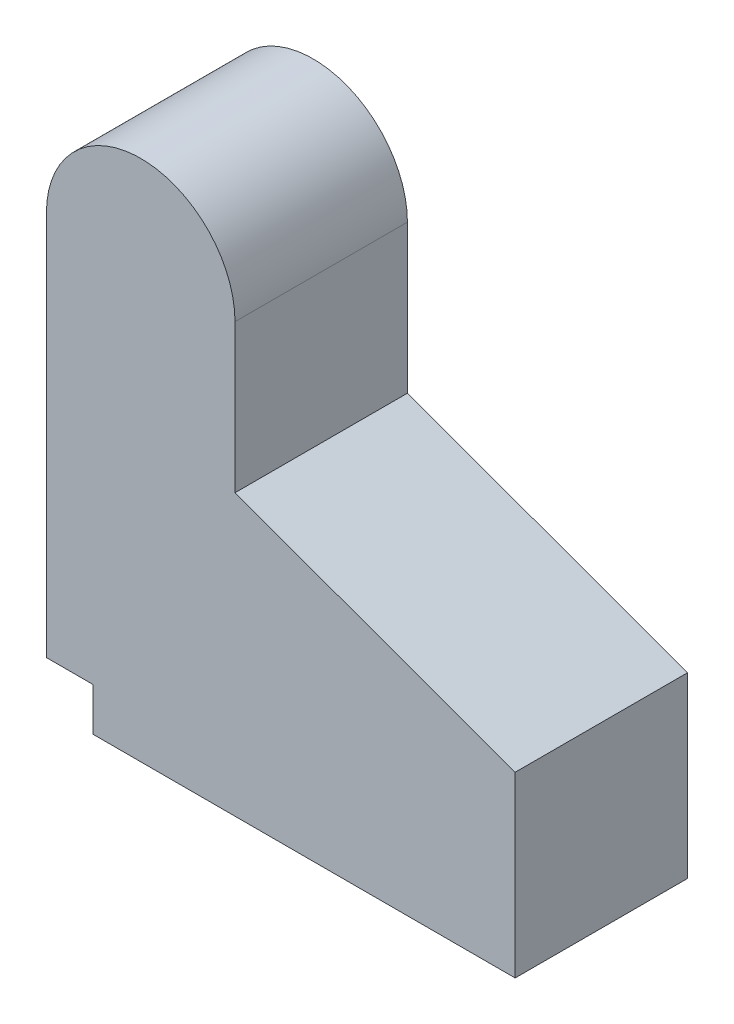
ISO-10303-21;
HEADER;
FILE_DESCRIPTION(('STEP AP214'),'2;1');
FILE_NAME('part.step','',(''),(''),'','','');
FILE_SCHEMA(('AUTOMOTIVE_DESIGN { 1 0 10303 214 1 1 1 1 }'));
ENDSEC;
DATA;
#1=APPLICATION_CONTEXT('core data for automotive mechanical design processes');
#2=APPLICATION_PROTOCOL_DEFINITION('international standard','automotive_design',2000,#1);
#3=PRODUCT_CONTEXT('',#1,'mechanical');
#4=PRODUCT('Part','Part','',(#3));
#5=PRODUCT_RELATED_PRODUCT_CATEGORY('part','',(#4));
#6=PRODUCT_DEFINITION_FORMATION('','',#4);
#7=PRODUCT_DEFINITION_CONTEXT('part definition',#1,'design');
#8=PRODUCT_DEFINITION('design','',#6,#7);
#9=PRODUCT_DEFINITION_SHAPE('','',#8);
#10=(LENGTH_UNIT() NAMED_UNIT(*) SI_UNIT(.MILLI.,.METRE.));
#11=(NAMED_UNIT(*) PLANE_ANGLE_UNIT() SI_UNIT($,.RADIAN.));
#12=(NAMED_UNIT(*) SI_UNIT($,.STERADIAN.) SOLID_ANGLE_UNIT());
#13=UNCERTAINTY_MEASURE_WITH_UNIT(LENGTH_MEASURE(1.E-05),#10,'distance_accuracy_value','');
#14=(GEOMETRIC_REPRESENTATION_CONTEXT(3) GLOBAL_UNCERTAINTY_ASSIGNED_CONTEXT((#13)) GLOBAL_UNIT_ASSIGNED_CONTEXT((#10,
#11,#12)) REPRESENTATION_CONTEXT('',''));
#15=CARTESIAN_POINT('',(0.,0.,0.));
#16=DIRECTION('',(0.,0.,1.));
#17=DIRECTION('',(1.,0.,0.));
#18=AXIS2_PLACEMENT_3D('',#15,#16,#17);
#19=CARTESIAN_POINT('',(4.3,0.,16.));
#20=DIRECTION('',(1.,0.,0.));
#21=DIRECTION('',(0.,1.,0.));
#22=AXIS2_PLACEMENT_3D('',#19,#20,#21);
#23=PLANE('',#22);
#24=DIRECTION('',(0.,-1.,0.));
#25=VECTOR('',#24,1.);
#26=CARTESIAN_POINT('',(4.3,0.,0.));
#27=LINE('',#26,#25);
#28=CARTESIAN_POINT('',(4.3,4.,0.));
#29=VERTEX_POINT('',#28);
#30=CARTESIAN_POINT('',(4.3,0.,0.));
#31=VERTEX_POINT('',#30);
#32=EDGE_CURVE('E127',#29,#31,#27,.T.);
#33=ORIENTED_EDGE('',*,*,#32,.T.);
#34=DIRECTION('',(0.,0.,-1.));
#35=VECTOR('',#34,1.);
#36=CARTESIAN_POINT('',(4.3,0.,16.));
#37=LINE('',#36,#35);
#38=CARTESIAN_POINT('',(4.3,0.,16.));
#39=VERTEX_POINT('',#38);
#40=EDGE_CURVE('E11',#39,#31,#37,.T.);
#41=ORIENTED_EDGE('',*,*,#40,.F.);
#42=DIRECTION('',(0.,-1.,0.));
#43=VECTOR('',#42,1.);
#44=CARTESIAN_POINT('',(4.3,0.,16.));
#45=LINE('',#44,#43);
#46=CARTESIAN_POINT('',(4.3,4.,16.));
#47=VERTEX_POINT('',#46);
#48=EDGE_CURVE('E141',#47,#39,#45,.T.);
#49=ORIENTED_EDGE('',*,*,#48,.F.);
#50=DIRECTION('',(0.,0.,-1.));
#51=VECTOR('',#50,1.);
#52=CARTESIAN_POINT('',(4.3,4.,16.));
#53=LINE('',#52,#51);
#54=EDGE_CURVE('E123',#47,#29,#53,.T.);
#55=ORIENTED_EDGE('',*,*,#54,.T.);
#56=EDGE_LOOP('',(#33,#41,#49,#55));
#57=FACE_BOUND('',#56,.T.);
#58=ADVANCED_FACE('F31',(#57),#23,.F.);
#59=CARTESIAN_POINT('',(4.3,0.,16.));
#60=DIRECTION('',(0.,1.,0.));
#61=DIRECTION('',(-1.,0.,0.));
#62=AXIS2_PLACEMENT_3D('',#59,#60,#61);
#63=PLANE('',#62);
#64=DIRECTION('',(1.,0.,0.));
#65=VECTOR('',#64,1.);
#66=CARTESIAN_POINT('',(4.3,0.,0.));
#67=LINE('',#66,#65);
#68=CARTESIAN_POINT('',(43.5,0.,0.));
#69=VERTEX_POINT('',#68);
#70=EDGE_CURVE('E130',#31,#69,#67,.T.);
#71=ORIENTED_EDGE('',*,*,#70,.T.);
#72=DIRECTION('',(0.,0.,-1.));
#73=VECTOR('',#72,1.);
#74=CARTESIAN_POINT('',(43.5,0.,16.));
#75=LINE('',#74,#73);
#76=CARTESIAN_POINT('',(43.5,0.,16.));
#77=VERTEX_POINT('',#76);
#78=EDGE_CURVE('E39',#77,#69,#75,.T.);
#79=ORIENTED_EDGE('',*,*,#78,.F.);
#80=DIRECTION('',(1.,0.,0.));
#81=VECTOR('',#80,1.);
#82=CARTESIAN_POINT('',(4.3,0.,16.));
#83=LINE('',#82,#81);
#84=EDGE_CURVE('E90',#39,#77,#83,.T.);
#85=ORIENTED_EDGE('',*,*,#84,.F.);
#86=ORIENTED_EDGE('',*,*,#40,.T.);
#87=EDGE_LOOP('',(#71,#79,#85,#86));
#88=FACE_BOUND('',#87,.T.);
#89=ADVANCED_FACE('F176',(#88),#63,.F.);
#90=CARTESIAN_POINT('',(43.5,0.,16.));
#91=DIRECTION('',(-1.,0.,0.));
#92=DIRECTION('',(0.,0.,1.));
#93=AXIS2_PLACEMENT_3D('',#90,#91,#92);
#94=PLANE('',#93);
#95=DIRECTION('',(0.,1.,0.));
#96=VECTOR('',#95,1.);
#97=CARTESIAN_POINT('',(43.5,0.,0.));
#98=LINE('',#97,#96);
#99=CARTESIAN_POINT('',(43.5,16.5367739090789,0.));
#100=VERTEX_POINT('',#99);
#101=EDGE_CURVE('E132',#69,#100,#98,.T.);
#102=ORIENTED_EDGE('',*,*,#101,.T.);
#103=DIRECTION('',(0.,0.,-1.));
#104=VECTOR('',#103,1.);
#105=CARTESIAN_POINT('',(43.5,16.5367739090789,16.));
#106=LINE('',#105,#104);
#107=CARTESIAN_POINT('',(43.5,16.5367739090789,16.));
#108=VERTEX_POINT('',#107);
#109=EDGE_CURVE('E148',#108,#100,#106,.T.);
#110=ORIENTED_EDGE('',*,*,#109,.F.);
#111=DIRECTION('',(0.,1.,0.));
#112=VECTOR('',#111,1.);
#113=CARTESIAN_POINT('',(43.5,0.,16.));
#114=LINE('',#113,#112);
#115=EDGE_CURVE('E156',#77,#108,#114,.T.);
#116=ORIENTED_EDGE('',*,*,#115,.F.);
#117=ORIENTED_EDGE('',*,*,#78,.T.);
#118=EDGE_LOOP('',(#102,#110,#116,#117));
#119=FACE_BOUND('',#118,.T.);
#120=ADVANCED_FACE('F154',(#119),#94,.F.);
#121=CARTESIAN_POINT('',(43.5,16.5367739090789,16.));
#122=DIRECTION('',(-0.342020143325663,-0.939692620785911,0.));
#123=DIRECTION('',(0.939692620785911,-0.342020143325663,0.));
#124=AXIS2_PLACEMENT_3D('',#121,#122,#123);
#125=PLANE('',#124);
#126=DIRECTION('',(-0.939692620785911,0.342020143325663,0.));
#127=VECTOR('',#126,1.);
#128=CARTESIAN_POINT('',(43.5,16.5367739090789,0.));
#129=LINE('',#128,#127);
#130=CARTESIAN_POINT('',(17.5,26.,0.));
#131=VERTEX_POINT('',#130);
#132=EDGE_CURVE('E134',#100,#131,#129,.T.);
#133=ORIENTED_EDGE('',*,*,#132,.T.);
#134=DIRECTION('',(0.,0.,-1.));
#135=VECTOR('',#134,1.);
#136=CARTESIAN_POINT('',(17.5,26.,16.));
#137=LINE('',#136,#135);
#138=CARTESIAN_POINT('',(17.5,26.,16.));
#139=VERTEX_POINT('',#138);
#140=EDGE_CURVE('E145',#139,#131,#137,.T.);
#141=ORIENTED_EDGE('',*,*,#140,.F.);
#142=DIRECTION('',(-0.939692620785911,0.342020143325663,0.));
#143=VECTOR('',#142,1.);
#144=CARTESIAN_POINT('',(43.5,16.5367739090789,16.));
#145=LINE('',#144,#143);
#146=EDGE_CURVE('E168',#108,#139,#145,.T.);
#147=ORIENTED_EDGE('',*,*,#146,.F.);
#148=ORIENTED_EDGE('',*,*,#109,.T.);
#149=EDGE_LOOP('',(#133,#141,#147,#148));
#150=FACE_BOUND('',#149,.T.);
#151=ADVANCED_FACE('F164',(#150),#125,.F.);
#152=CARTESIAN_POINT('',(17.5,26.,16.));
#153=DIRECTION('',(-1.,0.,0.));
#154=DIRECTION('',(0.,-1.,0.));
#155=AXIS2_PLACEMENT_3D('',#152,#153,#154);
#156=PLANE('',#155);
#157=DIRECTION('',(0.,1.,0.));
#158=VECTOR('',#157,1.);
#159=CARTESIAN_POINT('',(17.5,26.,0.));
#160=LINE('',#159,#158);
#161=CARTESIAN_POINT('',(17.5,39.75,0.));
#162=VERTEX_POINT('',#161);
#163=EDGE_CURVE('E136',#131,#162,#160,.T.);
#164=ORIENTED_EDGE('',*,*,#163,.T.);
#165=DIRECTION('',(0.,0.,-1.));
#166=VECTOR('',#165,1.);
#167=CARTESIAN_POINT('',(17.5,39.75,16.));
#168=LINE('',#167,#166);
#169=CARTESIAN_POINT('',(17.5,39.75,16.));
#170=VERTEX_POINT('',#169);
#171=EDGE_CURVE('E118',#170,#162,#168,.T.);
#172=ORIENTED_EDGE('',*,*,#171,.F.);
#173=DIRECTION('',(0.,1.,0.));
#174=VECTOR('',#173,1.);
#175=CARTESIAN_POINT('',(17.5,26.,16.));
#176=LINE('',#175,#174);
#177=EDGE_CURVE('E109',#139,#170,#176,.T.);
#178=ORIENTED_EDGE('',*,*,#177,.F.);
#179=ORIENTED_EDGE('',*,*,#140,.T.);
#180=EDGE_LOOP('',(#164,#172,#178,#179));
#181=FACE_BOUND('',#180,.T.);
#182=ADVANCED_FACE('F167',(#181),#156,.F.);
#183=CARTESIAN_POINT('',(8.74999999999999,39.75,16.));
#184=DIRECTION('',(0.,0.,-1.));
#185=DIRECTION('',(-1.,0.,0.));
#186=AXIS2_PLACEMENT_3D('',#183,#184,#185);
#187=CYLINDRICAL_SURFACE('',#186,8.75);
#188=CARTESIAN_POINT('',(8.74999999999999,39.75,0.));
#189=DIRECTION('',(0.,0.,1.));
#190=DIRECTION('',(-1.,0.,0.));
#191=AXIS2_PLACEMENT_3D('',#188,#189,#190);
#192=CIRCLE('',#191,8.75);
#193=CARTESIAN_POINT('',(0.,39.75,0.));
#194=VERTEX_POINT('',#193);
#195=EDGE_CURVE('E117',#162,#194,#192,.T.);
#196=ORIENTED_EDGE('',*,*,#195,.T.);
#197=DIRECTION('',(0.,0.,-1.));
#198=VECTOR('',#197,1.);
#199=CARTESIAN_POINT('',(0.,39.75,16.));
#200=LINE('',#199,#198);
#201=CARTESIAN_POINT('',(0.,39.75,16.));
#202=VERTEX_POINT('',#201);
#203=EDGE_CURVE('E114',#202,#194,#200,.T.);
#204=ORIENTED_EDGE('',*,*,#203,.F.);
#205=CARTESIAN_POINT('',(8.74999999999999,39.75,16.));
#206=DIRECTION('',(0.,0.,1.));
#207=DIRECTION('',(-1.,0.,0.));
#208=AXIS2_PLACEMENT_3D('',#205,#206,#207);
#209=CIRCLE('',#208,8.75);
#210=EDGE_CURVE('E103',#170,#202,#209,.T.);
#211=ORIENTED_EDGE('',*,*,#210,.F.);
#212=ORIENTED_EDGE('',*,*,#171,.T.);
#213=EDGE_LOOP('',(#196,#204,#211,#212));
#214=FACE_BOUND('',#213,.T.);
#215=ADVANCED_FACE('F115',(#214),#187,.T.);
#216=CARTESIAN_POINT('',(0.,4.,16.));
#217=DIRECTION('',(1.,0.,0.));
#218=DIRECTION('',(0.,1.,0.));
#219=AXIS2_PLACEMENT_3D('',#216,#217,#218);
#220=PLANE('',#219);
#221=DIRECTION('',(0.,-1.,0.));
#222=VECTOR('',#221,1.);
#223=CARTESIAN_POINT('',(0.,4.,0.));
#224=LINE('',#223,#222);
#225=CARTESIAN_POINT('',(0.,4.,0.));
#226=VERTEX_POINT('',#225);
#227=EDGE_CURVE('E76',#194,#226,#224,.T.);
#228=ORIENTED_EDGE('',*,*,#227,.T.);
#229=DIRECTION('',(0.,0.,-1.));
#230=VECTOR('',#229,1.);
#231=CARTESIAN_POINT('',(0.,4.,16.));
#232=LINE('',#231,#230);
#233=CARTESIAN_POINT('',(0.,4.,16.));
#234=VERTEX_POINT('',#233);
#235=EDGE_CURVE('E119',#234,#226,#232,.T.);
#236=ORIENTED_EDGE('',*,*,#235,.F.);
#237=DIRECTION('',(0.,-1.,0.));
#238=VECTOR('',#237,1.);
#239=CARTESIAN_POINT('',(0.,4.,16.));
#240=LINE('',#239,#238);
#241=EDGE_CURVE('E107',#202,#234,#240,.T.);
#242=ORIENTED_EDGE('',*,*,#241,.F.);
#243=ORIENTED_EDGE('',*,*,#203,.T.);
#244=EDGE_LOOP('',(#228,#236,#242,#243));
#245=FACE_BOUND('',#244,.T.);
#246=ADVANCED_FACE('F121',(#245),#220,.F.);
#247=CARTESIAN_POINT('',(4.3,4.,16.));
#248=DIRECTION('',(0.,1.,0.));
#249=DIRECTION('',(0.,0.,1.));
#250=AXIS2_PLACEMENT_3D('',#247,#248,#249);
#251=PLANE('',#250);
#252=DIRECTION('',(1.,0.,0.));
#253=VECTOR('',#252,1.);
#254=CARTESIAN_POINT('',(4.3,4.,0.));
#255=LINE('',#254,#253);
#256=EDGE_CURVE('E82',#226,#29,#255,.T.);
#257=ORIENTED_EDGE('',*,*,#256,.T.);
#258=ORIENTED_EDGE('',*,*,#54,.F.);
#259=DIRECTION('',(1.,0.,0.));
#260=VECTOR('',#259,1.);
#261=CARTESIAN_POINT('',(4.3,4.,16.));
#262=LINE('',#261,#260);
#263=EDGE_CURVE('E47',#234,#47,#262,.T.);
#264=ORIENTED_EDGE('',*,*,#263,.F.);
#265=ORIENTED_EDGE('',*,*,#235,.T.);
#266=EDGE_LOOP('',(#257,#258,#264,#265));
#267=FACE_BOUND('',#266,.T.);
#268=ADVANCED_FACE('F192',(#267),#251,.F.);
#269=CARTESIAN_POINT('',(8.74999999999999,39.75,16.));
#270=DIRECTION('',(0.,0.,-1.));
#271=DIRECTION('',(-1.,0.,0.));
#272=AXIS2_PLACEMENT_3D('',#269,#270,#271);
#273=PLANE('',#272);
#274=ORIENTED_EDGE('',*,*,#48,.T.);
#275=ORIENTED_EDGE('',*,*,#84,.T.);
#276=ORIENTED_EDGE('',*,*,#115,.T.);
#277=ORIENTED_EDGE('',*,*,#146,.T.);
#278=ORIENTED_EDGE('',*,*,#177,.T.);
#279=ORIENTED_EDGE('',*,*,#210,.T.);
#280=ORIENTED_EDGE('',*,*,#241,.T.);
#281=ORIENTED_EDGE('',*,*,#263,.T.);
#282=EDGE_LOOP('',(#274,#275,#276,#277,#278,#279,#280,#281));
#283=FACE_BOUND('',#282,.T.);
#284=ADVANCED_FACE('F105',(#283),#273,.F.);
#285=CARTESIAN_POINT('',(8.74999999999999,39.75,0.));
#286=DIRECTION('',(0.,0.,-1.));
#287=DIRECTION('',(-1.,0.,0.));
#288=AXIS2_PLACEMENT_3D('',#285,#286,#287);
#289=PLANE('',#288);
#290=ORIENTED_EDGE('',*,*,#32,.F.);
#291=ORIENTED_EDGE('',*,*,#256,.F.);
#292=ORIENTED_EDGE('',*,*,#227,.F.);
#293=ORIENTED_EDGE('',*,*,#195,.F.);
#294=ORIENTED_EDGE('',*,*,#163,.F.);
#295=ORIENTED_EDGE('',*,*,#132,.F.);
#296=ORIENTED_EDGE('',*,*,#101,.F.);
#297=ORIENTED_EDGE('',*,*,#70,.F.);
#298=EDGE_LOOP('',(#290,#291,#292,#293,#294,#295,#296,#297));
#299=FACE_BOUND('',#298,.T.);
#300=ADVANCED_FACE('F160',(#299),#289,.T.);
#301=CLOSED_SHELL('',(#58,#89,#120,#151,#182,#215,#246,#268,#284,#300));
#302=MANIFOLD_SOLID_BREP('B2',#301);
#303=ADVANCED_BREP_SHAPE_REPRESENTATION('',(#18,#302),#14);
#304=SHAPE_DEFINITION_REPRESENTATION(#9,#303);
ENDSEC;
END-ISO-10303-21;
